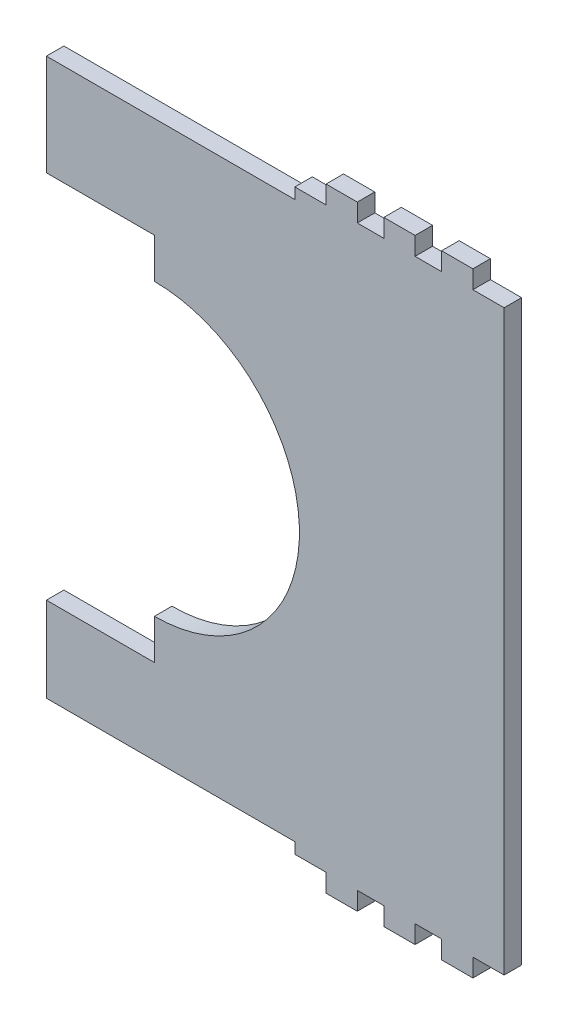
ISO-10303-21;
HEADER;
FILE_DESCRIPTION(('STEP AP214'),'2;1');
FILE_NAME('part.step','',(''),(''),'','','');
FILE_SCHEMA(('AUTOMOTIVE_DESIGN { 1 0 10303 214 1 1 1 1 }'));
ENDSEC;
DATA;
#1=APPLICATION_CONTEXT('core data for automotive mechanical design processes');
#2=APPLICATION_PROTOCOL_DEFINITION('international standard','automotive_design',2000,#1);
#3=PRODUCT_CONTEXT('',#1,'mechanical');
#4=PRODUCT('Part','Part','',(#3));
#5=PRODUCT_RELATED_PRODUCT_CATEGORY('part','',(#4));
#6=PRODUCT_DEFINITION_FORMATION('','',#4);
#7=PRODUCT_DEFINITION_CONTEXT('part definition',#1,'design');
#8=PRODUCT_DEFINITION('design','',#6,#7);
#9=PRODUCT_DEFINITION_SHAPE('','',#8);
#10=(LENGTH_UNIT() NAMED_UNIT(*) SI_UNIT(.MILLI.,.METRE.));
#11=(NAMED_UNIT(*) PLANE_ANGLE_UNIT() SI_UNIT($,.RADIAN.));
#12=(NAMED_UNIT(*) SI_UNIT($,.STERADIAN.) SOLID_ANGLE_UNIT());
#13=UNCERTAINTY_MEASURE_WITH_UNIT(LENGTH_MEASURE(1.E-05),#10,'distance_accuracy_value','');
#14=(GEOMETRIC_REPRESENTATION_CONTEXT(3) GLOBAL_UNCERTAINTY_ASSIGNED_CONTEXT((#13)) GLOBAL_UNIT_ASSIGNED_CONTEXT((#10,
#11,#12)) REPRESENTATION_CONTEXT('',''));
#15=CARTESIAN_POINT('',(0.,0.,0.));
#16=DIRECTION('',(0.,0.,1.));
#17=DIRECTION('',(1.,0.,0.));
#18=AXIS2_PLACEMENT_3D('',#15,#16,#17);
#19=CARTESIAN_POINT('',(0.,3.5,5.6));
#20=DIRECTION('',(1.,0.,0.));
#21=DIRECTION('',(0.,1.,0.));
#22=AXIS2_PLACEMENT_3D('',#19,#20,#21);
#23=PLANE('',#22);
#24=DIRECTION('',(0.,-1.,0.));
#25=VECTOR('',#24,1.);
#26=CARTESIAN_POINT('',(0.,3.5,0.));
#27=LINE('',#26,#25);
#28=CARTESIAN_POINT('',(0.,3.5,0.));
#29=VERTEX_POINT('',#28);
#30=CARTESIAN_POINT('',(0.,0.,0.));
#31=VERTEX_POINT('',#30);
#32=EDGE_CURVE('E314',#29,#31,#27,.T.);
#33=ORIENTED_EDGE('',*,*,#32,.T.);
#34=DIRECTION('',(0.,0.,-1.));
#35=VECTOR('',#34,1.);
#36=CARTESIAN_POINT('',(0.,0.,5.6));
#37=LINE('',#36,#35);
#38=CARTESIAN_POINT('',(0.,0.,5.6));
#39=VERTEX_POINT('',#38);
#40=EDGE_CURVE('E11',#39,#31,#37,.T.);
#41=ORIENTED_EDGE('',*,*,#40,.F.);
#42=DIRECTION('',(0.,-1.,0.));
#43=VECTOR('',#42,1.);
#44=CARTESIAN_POINT('',(0.,3.5,5.6));
#45=LINE('',#44,#43);
#46=CARTESIAN_POINT('',(0.,3.5,5.6));
#47=VERTEX_POINT('',#46);
#48=EDGE_CURVE('E390',#47,#39,#45,.T.);
#49=ORIENTED_EDGE('',*,*,#48,.F.);
#50=DIRECTION('',(0.,0.,-1.));
#51=VECTOR('',#50,1.);
#52=CARTESIAN_POINT('',(0.,3.5,5.6));
#53=LINE('',#52,#51);
#54=EDGE_CURVE('E310',#47,#29,#53,.T.);
#55=ORIENTED_EDGE('',*,*,#54,.T.);
#56=EDGE_LOOP('',(#33,#41,#49,#55));
#57=FACE_BOUND('',#56,.T.);
#58=ADVANCED_FACE('F37',(#57),#23,.F.);
#59=CARTESIAN_POINT('',(0.,0.,5.6));
#60=DIRECTION('',(0.,1.,0.));
#61=DIRECTION('',(0.,0.,1.));
#62=AXIS2_PLACEMENT_3D('',#59,#60,#61);
#63=PLANE('',#62);
#64=DIRECTION('',(1.,0.,0.));
#65=VECTOR('',#64,1.);
#66=CARTESIAN_POINT('',(0.,0.,0.));
#67=LINE('',#66,#65);
#68=CARTESIAN_POINT('',(9.99999999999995,0.,0.));
#69=VERTEX_POINT('',#68);
#70=EDGE_CURVE('E317',#31,#69,#67,.T.);
#71=ORIENTED_EDGE('',*,*,#70,.T.);
#72=DIRECTION('',(0.,0.,-1.));
#73=VECTOR('',#72,1.);
#74=CARTESIAN_POINT('',(9.99999999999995,0.,5.6));
#75=LINE('',#74,#73);
#76=CARTESIAN_POINT('',(9.99999999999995,0.,5.6));
#77=VERTEX_POINT('',#76);
#78=EDGE_CURVE('E45',#77,#69,#75,.T.);
#79=ORIENTED_EDGE('',*,*,#78,.F.);
#80=DIRECTION('',(1.,0.,0.));
#81=VECTOR('',#80,1.);
#82=CARTESIAN_POINT('',(0.,0.,5.6));
#83=LINE('',#82,#81);
#84=EDGE_CURVE('E184',#39,#77,#83,.T.);
#85=ORIENTED_EDGE('',*,*,#84,.F.);
#86=ORIENTED_EDGE('',*,*,#40,.T.);
#87=EDGE_LOOP('',(#71,#79,#85,#86));
#88=FACE_BOUND('',#87,.T.);
#89=ADVANCED_FACE('F588',(#88),#63,.F.);
#90=CARTESIAN_POINT('',(9.99999999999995,0.,5.6));
#91=DIRECTION('',(1.,0.,0.));
#92=DIRECTION('',(0.,1.,0.));
#93=AXIS2_PLACEMENT_3D('',#90,#91,#92);
#94=PLANE('',#93);
#95=DIRECTION('',(0.,-1.,0.));
#96=VECTOR('',#95,1.);
#97=CARTESIAN_POINT('',(9.99999999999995,0.,0.));
#98=LINE('',#97,#96);
#99=CARTESIAN_POINT('',(9.99999999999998,-5.8,0.));
#100=VERTEX_POINT('',#99);
#101=EDGE_CURVE('E319',#69,#100,#98,.T.);
#102=ORIENTED_EDGE('',*,*,#101,.T.);
#103=DIRECTION('',(0.,0.,-1.));
#104=VECTOR('',#103,1.);
#105=CARTESIAN_POINT('',(9.99999999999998,-5.8,5.6));
#106=LINE('',#105,#104);
#107=CARTESIAN_POINT('',(9.99999999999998,-5.8,5.6));
#108=VERTEX_POINT('',#107);
#109=EDGE_CURVE('E487',#108,#100,#106,.T.);
#110=ORIENTED_EDGE('',*,*,#109,.F.);
#111=DIRECTION('',(0.,-1.,0.));
#112=VECTOR('',#111,1.);
#113=CARTESIAN_POINT('',(9.99999999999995,0.,5.6));
#114=LINE('',#113,#112);
#115=EDGE_CURVE('E495',#77,#108,#114,.T.);
#116=ORIENTED_EDGE('',*,*,#115,.F.);
#117=ORIENTED_EDGE('',*,*,#78,.T.);
#118=EDGE_LOOP('',(#102,#110,#116,#117));
#119=FACE_BOUND('',#118,.T.);
#120=ADVANCED_FACE('F493',(#119),#94,.F.);
#121=CARTESIAN_POINT('',(9.99999999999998,-5.8,5.6));
#122=DIRECTION('',(0.,1.,0.));
#123=DIRECTION('',(0.,0.,1.));
#124=AXIS2_PLACEMENT_3D('',#121,#122,#123);
#125=PLANE('',#124);
#126=DIRECTION('',(1.,0.,0.));
#127=VECTOR('',#126,1.);
#128=CARTESIAN_POINT('',(9.99999999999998,-5.8,0.));
#129=LINE('',#128,#127);
#130=CARTESIAN_POINT('',(20.,-5.8,0.));
#131=VERTEX_POINT('',#130);
#132=EDGE_CURVE('E321',#100,#131,#129,.T.);
#133=ORIENTED_EDGE('',*,*,#132,.T.);
#134=DIRECTION('',(0.,0.,-1.));
#135=VECTOR('',#134,1.);
#136=CARTESIAN_POINT('',(20.,-5.8,5.6));
#137=LINE('',#136,#135);
#138=CARTESIAN_POINT('',(20.,-5.8,5.6));
#139=VERTEX_POINT('',#138);
#140=EDGE_CURVE('E484',#139,#131,#137,.T.);
#141=ORIENTED_EDGE('',*,*,#140,.F.);
#142=DIRECTION('',(1.,0.,0.));
#143=VECTOR('',#142,1.);
#144=CARTESIAN_POINT('',(9.99999999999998,-5.8,5.6));
#145=LINE('',#144,#143);
#146=EDGE_CURVE('E511',#108,#139,#145,.T.);
#147=ORIENTED_EDGE('',*,*,#146,.F.);
#148=ORIENTED_EDGE('',*,*,#109,.T.);
#149=EDGE_LOOP('',(#133,#141,#147,#148));
#150=FACE_BOUND('',#149,.T.);
#151=ADVANCED_FACE('F502',(#150),#125,.F.);
#152=CARTESIAN_POINT('',(20.,-5.8,5.6));
#153=DIRECTION('',(-1.,0.,0.));
#154=DIRECTION('',(0.,-1.,0.));
#155=AXIS2_PLACEMENT_3D('',#152,#153,#154);
#156=PLANE('',#155);
#157=DIRECTION('',(0.,1.,0.));
#158=VECTOR('',#157,1.);
#159=CARTESIAN_POINT('',(20.,-5.8,0.));
#160=LINE('',#159,#158);
#161=CARTESIAN_POINT('',(20.,0.,0.));
#162=VERTEX_POINT('',#161);
#163=EDGE_CURVE('E323',#131,#162,#160,.T.);
#164=ORIENTED_EDGE('',*,*,#163,.T.);
#165=DIRECTION('',(0.,0.,-1.));
#166=VECTOR('',#165,1.);
#167=CARTESIAN_POINT('',(20.,0.,5.6));
#168=LINE('',#167,#166);
#169=CARTESIAN_POINT('',(20.,0.,5.6));
#170=VERTEX_POINT('',#169);
#171=EDGE_CURVE('E481',#170,#162,#168,.T.);
#172=ORIENTED_EDGE('',*,*,#171,.F.);
#173=DIRECTION('',(0.,1.,0.));
#174=VECTOR('',#173,1.);
#175=CARTESIAN_POINT('',(20.,-5.8,5.6));
#176=LINE('',#175,#174);
#177=EDGE_CURVE('E508',#139,#170,#176,.T.);
#178=ORIENTED_EDGE('',*,*,#177,.F.);
#179=ORIENTED_EDGE('',*,*,#140,.T.);
#180=EDGE_LOOP('',(#164,#172,#178,#179));
#181=FACE_BOUND('',#180,.T.);
#182=ADVANCED_FACE('F506',(#181),#156,.F.);
#183=CARTESIAN_POINT('',(20.,0.,5.6));
#184=DIRECTION('',(0.,1.,0.));
#185=DIRECTION('',(0.,0.,1.));
#186=AXIS2_PLACEMENT_3D('',#183,#184,#185);
#187=PLANE('',#186);
#188=DIRECTION('',(1.,0.,0.));
#189=VECTOR('',#188,1.);
#190=CARTESIAN_POINT('',(20.,0.,0.));
#191=LINE('',#190,#189);
#192=CARTESIAN_POINT('',(28.5,0.,0.));
#193=VERTEX_POINT('',#192);
#194=EDGE_CURVE('E325',#162,#193,#191,.T.);
#195=ORIENTED_EDGE('',*,*,#194,.T.);
#196=DIRECTION('',(0.,0.,-1.));
#197=VECTOR('',#196,1.);
#198=CARTESIAN_POINT('',(28.5,0.,5.6));
#199=LINE('',#198,#197);
#200=CARTESIAN_POINT('',(28.5,0.,5.6));
#201=VERTEX_POINT('',#200);
#202=EDGE_CURVE('E478',#201,#193,#199,.T.);
#203=ORIENTED_EDGE('',*,*,#202,.F.);
#204=DIRECTION('',(1.,0.,0.));
#205=VECTOR('',#204,1.);
#206=CARTESIAN_POINT('',(20.,0.,5.6));
#207=LINE('',#206,#205);
#208=EDGE_CURVE('E510',#170,#201,#207,.T.);
#209=ORIENTED_EDGE('',*,*,#208,.F.);
#210=ORIENTED_EDGE('',*,*,#171,.T.);
#211=EDGE_LOOP('',(#195,#203,#209,#210));
#212=FACE_BOUND('',#211,.T.);
#213=ADVANCED_FACE('F600',(#212),#187,.F.);
#214=CARTESIAN_POINT('',(28.5,0.,5.6));
#215=DIRECTION('',(1.,0.,0.));
#216=DIRECTION('',(0.,1.,0.));
#217=AXIS2_PLACEMENT_3D('',#214,#215,#216);
#218=PLANE('',#217);
#219=DIRECTION('',(0.,-1.,0.));
#220=VECTOR('',#219,1.);
#221=CARTESIAN_POINT('',(28.5,0.,0.));
#222=LINE('',#221,#220);
#223=CARTESIAN_POINT('',(28.5,-5.8,0.));
#224=VERTEX_POINT('',#223);
#225=EDGE_CURVE('E327',#193,#224,#222,.T.);
#226=ORIENTED_EDGE('',*,*,#225,.T.);
#227=DIRECTION('',(0.,0.,-1.));
#228=VECTOR('',#227,1.);
#229=CARTESIAN_POINT('',(28.5,-5.8,5.6));
#230=LINE('',#229,#228);
#231=CARTESIAN_POINT('',(28.5,-5.8,5.6));
#232=VERTEX_POINT('',#231);
#233=EDGE_CURVE('E475',#232,#224,#230,.T.);
#234=ORIENTED_EDGE('',*,*,#233,.F.);
#235=DIRECTION('',(0.,-1.,0.));
#236=VECTOR('',#235,1.);
#237=CARTESIAN_POINT('',(28.5,0.,5.6));
#238=LINE('',#237,#236);
#239=EDGE_CURVE('E513',#201,#232,#238,.T.);
#240=ORIENTED_EDGE('',*,*,#239,.F.);
#241=ORIENTED_EDGE('',*,*,#202,.T.);
#242=EDGE_LOOP('',(#226,#234,#240,#241));
#243=FACE_BOUND('',#242,.T.);
#244=ADVANCED_FACE('F603',(#243),#218,.F.);
#245=CARTESIAN_POINT('',(28.5,-5.8,5.6));
#246=DIRECTION('',(0.,1.,0.));
#247=DIRECTION('',(0.,0.,1.));
#248=AXIS2_PLACEMENT_3D('',#245,#246,#247);
#249=PLANE('',#248);
#250=DIRECTION('',(1.,0.,0.));
#251=VECTOR('',#250,1.);
#252=CARTESIAN_POINT('',(28.5,-5.8,0.));
#253=LINE('',#252,#251);
#254=CARTESIAN_POINT('',(38.5,-5.8,0.));
#255=VERTEX_POINT('',#254);
#256=EDGE_CURVE('E329',#224,#255,#253,.T.);
#257=ORIENTED_EDGE('',*,*,#256,.T.);
#258=DIRECTION('',(0.,0.,-1.));
#259=VECTOR('',#258,1.);
#260=CARTESIAN_POINT('',(38.5,-5.8,5.6));
#261=LINE('',#260,#259);
#262=CARTESIAN_POINT('',(38.5,-5.8,5.6));
#263=VERTEX_POINT('',#262);
#264=EDGE_CURVE('E472',#263,#255,#261,.T.);
#265=ORIENTED_EDGE('',*,*,#264,.F.);
#266=DIRECTION('',(1.,0.,0.));
#267=VECTOR('',#266,1.);
#268=CARTESIAN_POINT('',(28.5,-5.8,5.6));
#269=LINE('',#268,#267);
#270=EDGE_CURVE('E519',#232,#263,#269,.T.);
#271=ORIENTED_EDGE('',*,*,#270,.F.);
#272=ORIENTED_EDGE('',*,*,#233,.T.);
#273=EDGE_LOOP('',(#257,#265,#271,#272));
#274=FACE_BOUND('',#273,.T.);
#275=ADVANCED_FACE('F607',(#274),#249,.F.);
#276=CARTESIAN_POINT('',(38.5,-5.8,5.6));
#277=DIRECTION('',(-1.,0.,0.));
#278=DIRECTION('',(0.,-1.,0.));
#279=AXIS2_PLACEMENT_3D('',#276,#277,#278);
#280=PLANE('',#279);
#281=DIRECTION('',(0.,1.,0.));
#282=VECTOR('',#281,1.);
#283=CARTESIAN_POINT('',(38.5,-5.8,0.));
#284=LINE('',#283,#282);
#285=CARTESIAN_POINT('',(38.5,0.,0.));
#286=VERTEX_POINT('',#285);
#287=EDGE_CURVE('E331',#255,#286,#284,.T.);
#288=ORIENTED_EDGE('',*,*,#287,.T.);
#289=DIRECTION('',(0.,0.,-1.));
#290=VECTOR('',#289,1.);
#291=CARTESIAN_POINT('',(38.5,0.,5.6));
#292=LINE('',#291,#290);
#293=CARTESIAN_POINT('',(38.5,0.,5.6));
#294=VERTEX_POINT('',#293);
#295=EDGE_CURVE('E469',#294,#286,#292,.T.);
#296=ORIENTED_EDGE('',*,*,#295,.F.);
#297=DIRECTION('',(0.,1.,0.));
#298=VECTOR('',#297,1.);
#299=CARTESIAN_POINT('',(38.5,-5.8,5.6));
#300=LINE('',#299,#298);
#301=EDGE_CURVE('E521',#263,#294,#300,.T.);
#302=ORIENTED_EDGE('',*,*,#301,.F.);
#303=ORIENTED_EDGE('',*,*,#264,.T.);
#304=EDGE_LOOP('',(#288,#296,#302,#303));
#305=FACE_BOUND('',#304,.T.);
#306=ADVANCED_FACE('F611',(#305),#280,.F.);
#307=CARTESIAN_POINT('',(38.5,0.,5.6));
#308=DIRECTION('',(0.,1.,0.));
#309=DIRECTION('',(0.,0.,1.));
#310=AXIS2_PLACEMENT_3D('',#307,#308,#309);
#311=PLANE('',#310);
#312=DIRECTION('',(1.,0.,0.));
#313=VECTOR('',#312,1.);
#314=CARTESIAN_POINT('',(38.5,0.,0.));
#315=LINE('',#314,#313);
#316=CARTESIAN_POINT('',(47.,0.,0.));
#317=VERTEX_POINT('',#316);
#318=EDGE_CURVE('E333',#286,#317,#315,.T.);
#319=ORIENTED_EDGE('',*,*,#318,.T.);
#320=DIRECTION('',(0.,0.,-1.));
#321=VECTOR('',#320,1.);
#322=CARTESIAN_POINT('',(47.,0.,5.6));
#323=LINE('',#322,#321);
#324=CARTESIAN_POINT('',(47.,0.,5.6));
#325=VERTEX_POINT('',#324);
#326=EDGE_CURVE('E466',#325,#317,#323,.T.);
#327=ORIENTED_EDGE('',*,*,#326,.F.);
#328=DIRECTION('',(1.,0.,0.));
#329=VECTOR('',#328,1.);
#330=CARTESIAN_POINT('',(38.5,0.,5.6));
#331=LINE('',#330,#329);
#332=EDGE_CURVE('E523',#294,#325,#331,.T.);
#333=ORIENTED_EDGE('',*,*,#332,.F.);
#334=ORIENTED_EDGE('',*,*,#295,.T.);
#335=EDGE_LOOP('',(#319,#327,#333,#334));
#336=FACE_BOUND('',#335,.T.);
#337=ADVANCED_FACE('F615',(#336),#311,.F.);
#338=CARTESIAN_POINT('',(47.,0.,5.6));
#339=DIRECTION('',(1.,0.,0.));
#340=DIRECTION('',(0.,0.,-1.));
#341=AXIS2_PLACEMENT_3D('',#338,#339,#340);
#342=PLANE('',#341);
#343=DIRECTION('',(0.,-1.,0.));
#344=VECTOR('',#343,1.);
#345=CARTESIAN_POINT('',(47.,0.,0.));
#346=LINE('',#345,#344);
#347=CARTESIAN_POINT('',(47.,-5.8,0.));
#348=VERTEX_POINT('',#347);
#349=EDGE_CURVE('E335',#317,#348,#346,.T.);
#350=ORIENTED_EDGE('',*,*,#349,.T.);
#351=DIRECTION('',(0.,0.,-1.));
#352=VECTOR('',#351,1.);
#353=CARTESIAN_POINT('',(47.,-5.8,5.6));
#354=LINE('',#353,#352);
#355=CARTESIAN_POINT('',(47.,-5.8,5.6));
#356=VERTEX_POINT('',#355);
#357=EDGE_CURVE('E463',#356,#348,#354,.T.);
#358=ORIENTED_EDGE('',*,*,#357,.F.);
#359=DIRECTION('',(0.,-1.,0.));
#360=VECTOR('',#359,1.);
#361=CARTESIAN_POINT('',(47.,0.,5.6));
#362=LINE('',#361,#360);
#363=EDGE_CURVE('E525',#325,#356,#362,.T.);
#364=ORIENTED_EDGE('',*,*,#363,.F.);
#365=ORIENTED_EDGE('',*,*,#326,.T.);
#366=EDGE_LOOP('',(#350,#358,#364,#365));
#367=FACE_BOUND('',#366,.T.);
#368=ADVANCED_FACE('F619',(#367),#342,.F.);
#369=CARTESIAN_POINT('',(47.,-5.8,5.6));
#370=DIRECTION('',(0.,1.,0.));
#371=DIRECTION('',(0.,0.,1.));
#372=AXIS2_PLACEMENT_3D('',#369,#370,#371);
#373=PLANE('',#372);
#374=DIRECTION('',(1.,0.,0.));
#375=VECTOR('',#374,1.);
#376=CARTESIAN_POINT('',(47.,-5.8,0.));
#377=LINE('',#376,#375);
#378=CARTESIAN_POINT('',(57.,-5.8,0.));
#379=VERTEX_POINT('',#378);
#380=EDGE_CURVE('E337',#348,#379,#377,.T.);
#381=ORIENTED_EDGE('',*,*,#380,.T.);
#382=DIRECTION('',(0.,0.,-1.));
#383=VECTOR('',#382,1.);
#384=CARTESIAN_POINT('',(57.,-5.8,5.6));
#385=LINE('',#384,#383);
#386=CARTESIAN_POINT('',(57.,-5.8,5.6));
#387=VERTEX_POINT('',#386);
#388=EDGE_CURVE('E460',#387,#379,#385,.T.);
#389=ORIENTED_EDGE('',*,*,#388,.F.);
#390=DIRECTION('',(1.,0.,0.));
#391=VECTOR('',#390,1.);
#392=CARTESIAN_POINT('',(47.,-5.8,5.6));
#393=LINE('',#392,#391);
#394=EDGE_CURVE('E527',#356,#387,#393,.T.);
#395=ORIENTED_EDGE('',*,*,#394,.F.);
#396=ORIENTED_EDGE('',*,*,#357,.T.);
#397=EDGE_LOOP('',(#381,#389,#395,#396));
#398=FACE_BOUND('',#397,.T.);
#399=ADVANCED_FACE('F623',(#398),#373,.F.);
#400=CARTESIAN_POINT('',(57.,-5.8,5.6));
#401=DIRECTION('',(-1.,0.,0.));
#402=DIRECTION('',(0.,-1.,0.));
#403=AXIS2_PLACEMENT_3D('',#400,#401,#402);
#404=PLANE('',#403);
#405=DIRECTION('',(0.,1.,0.));
#406=VECTOR('',#405,1.);
#407=CARTESIAN_POINT('',(57.,-5.8,0.));
#408=LINE('',#407,#406);
#409=CARTESIAN_POINT('',(57.,0.,0.));
#410=VERTEX_POINT('',#409);
#411=EDGE_CURVE('E339',#379,#410,#408,.T.);
#412=ORIENTED_EDGE('',*,*,#411,.T.);
#413=DIRECTION('',(0.,0.,-1.));
#414=VECTOR('',#413,1.);
#415=CARTESIAN_POINT('',(57.,0.,5.6));
#416=LINE('',#415,#414);
#417=CARTESIAN_POINT('',(57.,0.,5.6));
#418=VERTEX_POINT('',#417);
#419=EDGE_CURVE('E457',#418,#410,#416,.T.);
#420=ORIENTED_EDGE('',*,*,#419,.F.);
#421=DIRECTION('',(0.,1.,0.));
#422=VECTOR('',#421,1.);
#423=CARTESIAN_POINT('',(57.,-5.8,5.6));
#424=LINE('',#423,#422);
#425=EDGE_CURVE('E529',#387,#418,#424,.T.);
#426=ORIENTED_EDGE('',*,*,#425,.F.);
#427=ORIENTED_EDGE('',*,*,#388,.T.);
#428=EDGE_LOOP('',(#412,#420,#426,#427));
#429=FACE_BOUND('',#428,.T.);
#430=ADVANCED_FACE('F627',(#429),#404,.F.);
#431=CARTESIAN_POINT('',(57.,0.,5.6));
#432=DIRECTION('',(0.,1.,0.));
#433=DIRECTION('',(0.,0.,1.));
#434=AXIS2_PLACEMENT_3D('',#431,#432,#433);
#435=PLANE('',#434);
#436=DIRECTION('',(1.,0.,0.));
#437=VECTOR('',#436,1.);
#438=CARTESIAN_POINT('',(57.,0.,0.));
#439=LINE('',#438,#437);
#440=CARTESIAN_POINT('',(67.,0.,0.));
#441=VERTEX_POINT('',#440);
#442=EDGE_CURVE('E341',#410,#441,#439,.T.);
#443=ORIENTED_EDGE('',*,*,#442,.T.);
#444=DIRECTION('',(0.,0.,-1.));
#445=VECTOR('',#444,1.);
#446=CARTESIAN_POINT('',(67.,0.,5.6));
#447=LINE('',#446,#445);
#448=CARTESIAN_POINT('',(67.,0.,5.6));
#449=VERTEX_POINT('',#448);
#450=EDGE_CURVE('E454',#449,#441,#447,.T.);
#451=ORIENTED_EDGE('',*,*,#450,.F.);
#452=DIRECTION('',(1.,0.,0.));
#453=VECTOR('',#452,1.);
#454=CARTESIAN_POINT('',(57.,0.,5.6));
#455=LINE('',#454,#453);
#456=EDGE_CURVE('E531',#418,#449,#455,.T.);
#457=ORIENTED_EDGE('',*,*,#456,.F.);
#458=ORIENTED_EDGE('',*,*,#419,.T.);
#459=EDGE_LOOP('',(#443,#451,#457,#458));
#460=FACE_BOUND('',#459,.T.);
#461=ADVANCED_FACE('F631',(#460),#435,.F.);
#462=CARTESIAN_POINT('',(67.,0.,5.6));
#463=DIRECTION('',(-1.,0.,0.));
#464=DIRECTION('',(0.,-1.,0.));
#465=AXIS2_PLACEMENT_3D('',#462,#463,#464);
#466=PLANE('',#465);
#467=DIRECTION('',(0.,1.,0.));
#468=VECTOR('',#467,1.);
#469=CARTESIAN_POINT('',(67.,0.,0.));
#470=LINE('',#469,#468);
#471=CARTESIAN_POINT('',(67.,185.,0.));
#472=VERTEX_POINT('',#471);
#473=EDGE_CURVE('E343',#441,#472,#470,.T.);
#474=ORIENTED_EDGE('',*,*,#473,.T.);
#475=DIRECTION('',(0.,0.,-1.));
#476=VECTOR('',#475,1.);
#477=CARTESIAN_POINT('',(67.,185.,5.6));
#478=LINE('',#477,#476);
#479=CARTESIAN_POINT('',(67.,185.,5.6));
#480=VERTEX_POINT('',#479);
#481=EDGE_CURVE('E451',#480,#472,#478,.T.);
#482=ORIENTED_EDGE('',*,*,#481,.F.);
#483=DIRECTION('',(0.,1.,0.));
#484=VECTOR('',#483,1.);
#485=CARTESIAN_POINT('',(67.,0.,5.6));
#486=LINE('',#485,#484);
#487=EDGE_CURVE('E533',#449,#480,#486,.T.);
#488=ORIENTED_EDGE('',*,*,#487,.F.);
#489=ORIENTED_EDGE('',*,*,#450,.T.);
#490=EDGE_LOOP('',(#474,#482,#488,#489));
#491=FACE_BOUND('',#490,.T.);
#492=ADVANCED_FACE('F635',(#491),#466,.F.);
#493=CARTESIAN_POINT('',(67.,185.,5.6));
#494=DIRECTION('',(0.,-1.,0.));
#495=DIRECTION('',(0.,0.,-1.));
#496=AXIS2_PLACEMENT_3D('',#493,#494,#495);
#497=PLANE('',#496);
#498=DIRECTION('',(-1.,0.,0.));
#499=VECTOR('',#498,1.);
#500=CARTESIAN_POINT('',(67.,185.,0.));
#501=LINE('',#500,#499);
#502=CARTESIAN_POINT('',(57.,185.,0.));
#503=VERTEX_POINT('',#502);
#504=EDGE_CURVE('E345',#472,#503,#501,.T.);
#505=ORIENTED_EDGE('',*,*,#504,.T.);
#506=DIRECTION('',(0.,0.,-1.));
#507=VECTOR('',#506,1.);
#508=CARTESIAN_POINT('',(57.,185.,5.6));
#509=LINE('',#508,#507);
#510=CARTESIAN_POINT('',(57.,185.,5.6));
#511=VERTEX_POINT('',#510);
#512=EDGE_CURVE('E448',#511,#503,#509,.T.);
#513=ORIENTED_EDGE('',*,*,#512,.F.);
#514=DIRECTION('',(-1.,0.,0.));
#515=VECTOR('',#514,1.);
#516=CARTESIAN_POINT('',(67.,185.,5.6));
#517=LINE('',#516,#515);
#518=EDGE_CURVE('E535',#480,#511,#517,.T.);
#519=ORIENTED_EDGE('',*,*,#518,.F.);
#520=ORIENTED_EDGE('',*,*,#481,.T.);
#521=EDGE_LOOP('',(#505,#513,#519,#520));
#522=FACE_BOUND('',#521,.T.);
#523=ADVANCED_FACE('F639',(#522),#497,.F.);
#524=CARTESIAN_POINT('',(57.,185.,5.6));
#525=DIRECTION('',(-1.,0.,0.));
#526=DIRECTION('',(0.,0.,1.));
#527=AXIS2_PLACEMENT_3D('',#524,#525,#526);
#528=PLANE('',#527);
#529=DIRECTION('',(0.,1.,0.));
#530=VECTOR('',#529,1.);
#531=CARTESIAN_POINT('',(57.,185.,0.));
#532=LINE('',#531,#530);
#533=CARTESIAN_POINT('',(57.,190.8,0.));
#534=VERTEX_POINT('',#533);
#535=EDGE_CURVE('E347',#503,#534,#532,.T.);
#536=ORIENTED_EDGE('',*,*,#535,.T.);
#537=DIRECTION('',(0.,0.,-1.));
#538=VECTOR('',#537,1.);
#539=CARTESIAN_POINT('',(57.,190.8,5.6));
#540=LINE('',#539,#538);
#541=CARTESIAN_POINT('',(57.,190.8,5.6));
#542=VERTEX_POINT('',#541);
#543=EDGE_CURVE('E445',#542,#534,#540,.T.);
#544=ORIENTED_EDGE('',*,*,#543,.F.);
#545=DIRECTION('',(0.,1.,0.));
#546=VECTOR('',#545,1.);
#547=CARTESIAN_POINT('',(57.,185.,5.6));
#548=LINE('',#547,#546);
#549=EDGE_CURVE('E537',#511,#542,#548,.T.);
#550=ORIENTED_EDGE('',*,*,#549,.F.);
#551=ORIENTED_EDGE('',*,*,#512,.T.);
#552=EDGE_LOOP('',(#536,#544,#550,#551));
#553=FACE_BOUND('',#552,.T.);
#554=ADVANCED_FACE('F643',(#553),#528,.F.);
#555=CARTESIAN_POINT('',(57.,190.8,5.6));
#556=DIRECTION('',(0.,-1.,0.));
#557=DIRECTION('',(0.,0.,-1.));
#558=AXIS2_PLACEMENT_3D('',#555,#556,#557);
#559=PLANE('',#558);
#560=DIRECTION('',(-1.,0.,0.));
#561=VECTOR('',#560,1.);
#562=CARTESIAN_POINT('',(57.,190.8,0.));
#563=LINE('',#562,#561);
#564=CARTESIAN_POINT('',(47.,190.8,0.));
#565=VERTEX_POINT('',#564);
#566=EDGE_CURVE('E349',#534,#565,#563,.T.);
#567=ORIENTED_EDGE('',*,*,#566,.T.);
#568=DIRECTION('',(0.,0.,-1.));
#569=VECTOR('',#568,1.);
#570=CARTESIAN_POINT('',(47.,190.8,5.6));
#571=LINE('',#570,#569);
#572=CARTESIAN_POINT('',(47.,190.8,5.6));
#573=VERTEX_POINT('',#572);
#574=EDGE_CURVE('E442',#573,#565,#571,.T.);
#575=ORIENTED_EDGE('',*,*,#574,.F.);
#576=DIRECTION('',(-1.,0.,0.));
#577=VECTOR('',#576,1.);
#578=CARTESIAN_POINT('',(57.,190.8,5.6));
#579=LINE('',#578,#577);
#580=EDGE_CURVE('E539',#542,#573,#579,.T.);
#581=ORIENTED_EDGE('',*,*,#580,.F.);
#582=ORIENTED_EDGE('',*,*,#543,.T.);
#583=EDGE_LOOP('',(#567,#575,#581,#582));
#584=FACE_BOUND('',#583,.T.);
#585=ADVANCED_FACE('F647',(#584),#559,.F.);
#586=CARTESIAN_POINT('',(47.,190.8,5.6));
#587=DIRECTION('',(1.,0.,0.));
#588=DIRECTION('',(0.,0.,-1.));
#589=AXIS2_PLACEMENT_3D('',#586,#587,#588);
#590=PLANE('',#589);
#591=DIRECTION('',(0.,-1.,0.));
#592=VECTOR('',#591,1.);
#593=CARTESIAN_POINT('',(47.,190.8,0.));
#594=LINE('',#593,#592);
#595=CARTESIAN_POINT('',(47.,185.,0.));
#596=VERTEX_POINT('',#595);
#597=EDGE_CURVE('E351',#565,#596,#594,.T.);
#598=ORIENTED_EDGE('',*,*,#597,.T.);
#599=DIRECTION('',(0.,0.,-1.));
#600=VECTOR('',#599,1.);
#601=CARTESIAN_POINT('',(47.,185.,5.6));
#602=LINE('',#601,#600);
#603=CARTESIAN_POINT('',(47.,185.,5.6));
#604=VERTEX_POINT('',#603);
#605=EDGE_CURVE('E439',#604,#596,#602,.T.);
#606=ORIENTED_EDGE('',*,*,#605,.F.);
#607=DIRECTION('',(0.,-1.,0.));
#608=VECTOR('',#607,1.);
#609=CARTESIAN_POINT('',(47.,190.8,5.6));
#610=LINE('',#609,#608);
#611=EDGE_CURVE('E541',#573,#604,#610,.T.);
#612=ORIENTED_EDGE('',*,*,#611,.F.);
#613=ORIENTED_EDGE('',*,*,#574,.T.);
#614=EDGE_LOOP('',(#598,#606,#612,#613));
#615=FACE_BOUND('',#614,.T.);
#616=ADVANCED_FACE('F651',(#615),#590,.F.);
#617=CARTESIAN_POINT('',(47.,185.,5.6));
#618=DIRECTION('',(0.,-1.,0.));
#619=DIRECTION('',(0.,0.,-1.));
#620=AXIS2_PLACEMENT_3D('',#617,#618,#619);
#621=PLANE('',#620);
#622=DIRECTION('',(-1.,0.,0.));
#623=VECTOR('',#622,1.);
#624=CARTESIAN_POINT('',(47.,185.,0.));
#625=LINE('',#624,#623);
#626=CARTESIAN_POINT('',(38.5,185.,0.));
#627=VERTEX_POINT('',#626);
#628=EDGE_CURVE('E353',#596,#627,#625,.T.);
#629=ORIENTED_EDGE('',*,*,#628,.T.);
#630=DIRECTION('',(0.,0.,-1.));
#631=VECTOR('',#630,1.);
#632=CARTESIAN_POINT('',(38.5,185.,5.6));
#633=LINE('',#632,#631);
#634=CARTESIAN_POINT('',(38.5,185.,5.6));
#635=VERTEX_POINT('',#634);
#636=EDGE_CURVE('E436',#635,#627,#633,.T.);
#637=ORIENTED_EDGE('',*,*,#636,.F.);
#638=DIRECTION('',(-1.,0.,0.));
#639=VECTOR('',#638,1.);
#640=CARTESIAN_POINT('',(47.,185.,5.6));
#641=LINE('',#640,#639);
#642=EDGE_CURVE('E543',#604,#635,#641,.T.);
#643=ORIENTED_EDGE('',*,*,#642,.F.);
#644=ORIENTED_EDGE('',*,*,#605,.T.);
#645=EDGE_LOOP('',(#629,#637,#643,#644));
#646=FACE_BOUND('',#645,.T.);
#647=ADVANCED_FACE('F655',(#646),#621,.F.);
#648=CARTESIAN_POINT('',(38.5,185.,5.6));
#649=DIRECTION('',(-1.,0.,0.));
#650=DIRECTION('',(0.,0.,1.));
#651=AXIS2_PLACEMENT_3D('',#648,#649,#650);
#652=PLANE('',#651);
#653=DIRECTION('',(0.,1.,0.));
#654=VECTOR('',#653,1.);
#655=CARTESIAN_POINT('',(38.5,185.,0.));
#656=LINE('',#655,#654);
#657=CARTESIAN_POINT('',(38.5,190.8,0.));
#658=VERTEX_POINT('',#657);
#659=EDGE_CURVE('E355',#627,#658,#656,.T.);
#660=ORIENTED_EDGE('',*,*,#659,.T.);
#661=DIRECTION('',(0.,0.,-1.));
#662=VECTOR('',#661,1.);
#663=CARTESIAN_POINT('',(38.5,190.8,5.6));
#664=LINE('',#663,#662);
#665=CARTESIAN_POINT('',(38.5,190.8,5.6));
#666=VERTEX_POINT('',#665);
#667=EDGE_CURVE('E433',#666,#658,#664,.T.);
#668=ORIENTED_EDGE('',*,*,#667,.F.);
#669=DIRECTION('',(0.,1.,0.));
#670=VECTOR('',#669,1.);
#671=CARTESIAN_POINT('',(38.5,185.,5.6));
#672=LINE('',#671,#670);
#673=EDGE_CURVE('E545',#635,#666,#672,.T.);
#674=ORIENTED_EDGE('',*,*,#673,.F.);
#675=ORIENTED_EDGE('',*,*,#636,.T.);
#676=EDGE_LOOP('',(#660,#668,#674,#675));
#677=FACE_BOUND('',#676,.T.);
#678=ADVANCED_FACE('F659',(#677),#652,.F.);
#679=CARTESIAN_POINT('',(38.5,190.8,5.6));
#680=DIRECTION('',(0.,-1.,0.));
#681=DIRECTION('',(1.,0.,0.));
#682=AXIS2_PLACEMENT_3D('',#679,#680,#681);
#683=PLANE('',#682);
#684=DIRECTION('',(-1.,0.,0.));
#685=VECTOR('',#684,1.);
#686=CARTESIAN_POINT('',(38.5,190.8,0.));
#687=LINE('',#686,#685);
#688=CARTESIAN_POINT('',(28.5,190.8,0.));
#689=VERTEX_POINT('',#688);
#690=EDGE_CURVE('E357',#658,#689,#687,.T.);
#691=ORIENTED_EDGE('',*,*,#690,.T.);
#692=DIRECTION('',(0.,0.,-1.));
#693=VECTOR('',#692,1.);
#694=CARTESIAN_POINT('',(28.5,190.8,5.6));
#695=LINE('',#694,#693);
#696=CARTESIAN_POINT('',(28.5,190.8,5.6));
#697=VERTEX_POINT('',#696);
#698=EDGE_CURVE('E430',#697,#689,#695,.T.);
#699=ORIENTED_EDGE('',*,*,#698,.F.);
#700=DIRECTION('',(-1.,0.,0.));
#701=VECTOR('',#700,1.);
#702=CARTESIAN_POINT('',(38.5,190.8,5.6));
#703=LINE('',#702,#701);
#704=EDGE_CURVE('E547',#666,#697,#703,.T.);
#705=ORIENTED_EDGE('',*,*,#704,.F.);
#706=ORIENTED_EDGE('',*,*,#667,.T.);
#707=EDGE_LOOP('',(#691,#699,#705,#706));
#708=FACE_BOUND('',#707,.T.);
#709=ADVANCED_FACE('F663',(#708),#683,.F.);
#710=CARTESIAN_POINT('',(28.5,190.8,5.6));
#711=DIRECTION('',(1.,0.,0.));
#712=DIRECTION('',(0.,1.,0.));
#713=AXIS2_PLACEMENT_3D('',#710,#711,#712);
#714=PLANE('',#713);
#715=DIRECTION('',(0.,-1.,0.));
#716=VECTOR('',#715,1.);
#717=CARTESIAN_POINT('',(28.5,190.8,0.));
#718=LINE('',#717,#716);
#719=CARTESIAN_POINT('',(28.5,185.,0.));
#720=VERTEX_POINT('',#719);
#721=EDGE_CURVE('E359',#689,#720,#718,.T.);
#722=ORIENTED_EDGE('',*,*,#721,.T.);
#723=DIRECTION('',(0.,0.,-1.));
#724=VECTOR('',#723,1.);
#725=CARTESIAN_POINT('',(28.5,185.,5.6));
#726=LINE('',#725,#724);
#727=CARTESIAN_POINT('',(28.5,185.,5.6));
#728=VERTEX_POINT('',#727);
#729=EDGE_CURVE('E427',#728,#720,#726,.T.);
#730=ORIENTED_EDGE('',*,*,#729,.F.);
#731=DIRECTION('',(0.,-1.,0.));
#732=VECTOR('',#731,1.);
#733=CARTESIAN_POINT('',(28.5,190.8,5.6));
#734=LINE('',#733,#732);
#735=EDGE_CURVE('E549',#697,#728,#734,.T.);
#736=ORIENTED_EDGE('',*,*,#735,.F.);
#737=ORIENTED_EDGE('',*,*,#698,.T.);
#738=EDGE_LOOP('',(#722,#730,#736,#737));
#739=FACE_BOUND('',#738,.T.);
#740=ADVANCED_FACE('F667',(#739),#714,.F.);
#741=CARTESIAN_POINT('',(28.5,185.,5.6));
#742=DIRECTION('',(0.,-1.,0.));
#743=DIRECTION('',(0.,0.,-1.));
#744=AXIS2_PLACEMENT_3D('',#741,#742,#743);
#745=PLANE('',#744);
#746=DIRECTION('',(-1.,0.,0.));
#747=VECTOR('',#746,1.);
#748=CARTESIAN_POINT('',(28.5,185.,0.));
#749=LINE('',#748,#747);
#750=CARTESIAN_POINT('',(20.,185.,0.));
#751=VERTEX_POINT('',#750);
#752=EDGE_CURVE('E361',#720,#751,#749,.T.);
#753=ORIENTED_EDGE('',*,*,#752,.T.);
#754=DIRECTION('',(0.,0.,-1.));
#755=VECTOR('',#754,1.);
#756=CARTESIAN_POINT('',(20.,185.,5.6));
#757=LINE('',#756,#755);
#758=CARTESIAN_POINT('',(20.,185.,5.6));
#759=VERTEX_POINT('',#758);
#760=EDGE_CURVE('E424',#759,#751,#757,.T.);
#761=ORIENTED_EDGE('',*,*,#760,.F.);
#762=DIRECTION('',(-1.,0.,0.));
#763=VECTOR('',#762,1.);
#764=CARTESIAN_POINT('',(28.5,185.,5.6));
#765=LINE('',#764,#763);
#766=EDGE_CURVE('E551',#728,#759,#765,.T.);
#767=ORIENTED_EDGE('',*,*,#766,.F.);
#768=ORIENTED_EDGE('',*,*,#729,.T.);
#769=EDGE_LOOP('',(#753,#761,#767,#768));
#770=FACE_BOUND('',#769,.T.);
#771=ADVANCED_FACE('F671',(#770),#745,.F.);
#772=CARTESIAN_POINT('',(20.,185.,5.6));
#773=DIRECTION('',(-1.,0.,0.));
#774=DIRECTION('',(0.,0.,1.));
#775=AXIS2_PLACEMENT_3D('',#772,#773,#774);
#776=PLANE('',#775);
#777=DIRECTION('',(0.,1.,0.));
#778=VECTOR('',#777,1.);
#779=CARTESIAN_POINT('',(20.,185.,0.));
#780=LINE('',#779,#778);
#781=CARTESIAN_POINT('',(20.,190.8,0.));
#782=VERTEX_POINT('',#781);
#783=EDGE_CURVE('E363',#751,#782,#780,.T.);
#784=ORIENTED_EDGE('',*,*,#783,.T.);
#785=DIRECTION('',(0.,0.,-1.));
#786=VECTOR('',#785,1.);
#787=CARTESIAN_POINT('',(20.,190.8,5.6));
#788=LINE('',#787,#786);
#789=CARTESIAN_POINT('',(20.,190.8,5.6));
#790=VERTEX_POINT('',#789);
#791=EDGE_CURVE('E421',#790,#782,#788,.T.);
#792=ORIENTED_EDGE('',*,*,#791,.F.);
#793=DIRECTION('',(0.,1.,0.));
#794=VECTOR('',#793,1.);
#795=CARTESIAN_POINT('',(20.,185.,5.6));
#796=LINE('',#795,#794);
#797=EDGE_CURVE('E553',#759,#790,#796,.T.);
#798=ORIENTED_EDGE('',*,*,#797,.F.);
#799=ORIENTED_EDGE('',*,*,#760,.T.);
#800=EDGE_LOOP('',(#784,#792,#798,#799));
#801=FACE_BOUND('',#800,.T.);
#802=ADVANCED_FACE('F675',(#801),#776,.F.);
#803=CARTESIAN_POINT('',(20.,190.8,5.6));
#804=DIRECTION('',(0.,-1.,0.));
#805=DIRECTION('',(0.,0.,-1.));
#806=AXIS2_PLACEMENT_3D('',#803,#804,#805);
#807=PLANE('',#806);
#808=DIRECTION('',(-1.,0.,0.));
#809=VECTOR('',#808,1.);
#810=CARTESIAN_POINT('',(20.,190.8,0.));
#811=LINE('',#810,#809);
#812=CARTESIAN_POINT('',(9.99999999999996,190.8,0.));
#813=VERTEX_POINT('',#812);
#814=EDGE_CURVE('E365',#782,#813,#811,.T.);
#815=ORIENTED_EDGE('',*,*,#814,.T.);
#816=DIRECTION('',(0.,0.,-1.));
#817=VECTOR('',#816,1.);
#818=CARTESIAN_POINT('',(9.99999999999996,190.8,5.6));
#819=LINE('',#818,#817);
#820=CARTESIAN_POINT('',(9.99999999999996,190.8,5.6));
#821=VERTEX_POINT('',#820);
#822=EDGE_CURVE('E418',#821,#813,#819,.T.);
#823=ORIENTED_EDGE('',*,*,#822,.F.);
#824=DIRECTION('',(-1.,0.,0.));
#825=VECTOR('',#824,1.);
#826=CARTESIAN_POINT('',(20.,190.8,5.6));
#827=LINE('',#826,#825);
#828=EDGE_CURVE('E555',#790,#821,#827,.T.);
#829=ORIENTED_EDGE('',*,*,#828,.F.);
#830=ORIENTED_EDGE('',*,*,#791,.T.);
#831=EDGE_LOOP('',(#815,#823,#829,#830));
#832=FACE_BOUND('',#831,.T.);
#833=ADVANCED_FACE('F679',(#832),#807,.F.);
#834=CARTESIAN_POINT('',(9.99999999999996,190.8,5.6));
#835=DIRECTION('',(1.,0.,0.));
#836=DIRECTION('',(0.,1.,0.));
#837=AXIS2_PLACEMENT_3D('',#834,#835,#836);
#838=PLANE('',#837);
#839=DIRECTION('',(0.,-1.,0.));
#840=VECTOR('',#839,1.);
#841=CARTESIAN_POINT('',(9.99999999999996,190.8,0.));
#842=LINE('',#841,#840);
#843=CARTESIAN_POINT('',(9.99999999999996,185.,0.));
#844=VERTEX_POINT('',#843);
#845=EDGE_CURVE('E367',#813,#844,#842,.T.);
#846=ORIENTED_EDGE('',*,*,#845,.T.);
#847=DIRECTION('',(0.,0.,-1.));
#848=VECTOR('',#847,1.);
#849=CARTESIAN_POINT('',(9.99999999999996,185.,5.6));
#850=LINE('',#849,#848);
#851=CARTESIAN_POINT('',(9.99999999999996,185.,5.6));
#852=VERTEX_POINT('',#851);
#853=EDGE_CURVE('E415',#852,#844,#850,.T.);
#854=ORIENTED_EDGE('',*,*,#853,.F.);
#855=DIRECTION('',(0.,-1.,0.));
#856=VECTOR('',#855,1.);
#857=CARTESIAN_POINT('',(9.99999999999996,190.8,5.6));
#858=LINE('',#857,#856);
#859=EDGE_CURVE('E557',#821,#852,#858,.T.);
#860=ORIENTED_EDGE('',*,*,#859,.F.);
#861=ORIENTED_EDGE('',*,*,#822,.T.);
#862=EDGE_LOOP('',(#846,#854,#860,#861));
#863=FACE_BOUND('',#862,.T.);
#864=ADVANCED_FACE('F683',(#863),#838,.F.);
#865=CARTESIAN_POINT('',(9.99999999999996,185.,5.6));
#866=DIRECTION('',(0.,-1.,0.));
#867=DIRECTION('',(0.,0.,-1.));
#868=AXIS2_PLACEMENT_3D('',#865,#866,#867);
#869=PLANE('',#868);
#870=DIRECTION('',(-1.,0.,0.));
#871=VECTOR('',#870,1.);
#872=CARTESIAN_POINT('',(9.99999999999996,185.,0.));
#873=LINE('',#872,#871);
#874=CARTESIAN_POINT('',(0.,185.,0.));
#875=VERTEX_POINT('',#874);
#876=EDGE_CURVE('E369',#844,#875,#873,.T.);
#877=ORIENTED_EDGE('',*,*,#876,.T.);
#878=DIRECTION('',(0.,0.,-1.));
#879=VECTOR('',#878,1.);
#880=CARTESIAN_POINT('',(0.,185.,5.6));
#881=LINE('',#880,#879);
#882=CARTESIAN_POINT('',(0.,185.,5.6));
#883=VERTEX_POINT('',#882);
#884=EDGE_CURVE('E412',#883,#875,#881,.T.);
#885=ORIENTED_EDGE('',*,*,#884,.F.);
#886=DIRECTION('',(-1.,0.,0.));
#887=VECTOR('',#886,1.);
#888=CARTESIAN_POINT('',(9.99999999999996,185.,5.6));
#889=LINE('',#888,#887);
#890=EDGE_CURVE('E559',#852,#883,#889,.T.);
#891=ORIENTED_EDGE('',*,*,#890,.F.);
#892=ORIENTED_EDGE('',*,*,#853,.T.);
#893=EDGE_LOOP('',(#877,#885,#891,#892));
#894=FACE_BOUND('',#893,.T.);
#895=ADVANCED_FACE('F687',(#894),#869,.F.);
#896=CARTESIAN_POINT('',(0.,185.,5.6));
#897=DIRECTION('',(1.,0.,0.));
#898=DIRECTION('',(0.,1.,0.));
#899=AXIS2_PLACEMENT_3D('',#896,#897,#898);
#900=PLANE('',#899);
#901=DIRECTION('',(0.,-1.,0.));
#902=VECTOR('',#901,1.);
#903=CARTESIAN_POINT('',(0.,185.,0.));
#904=LINE('',#903,#902);
#905=CARTESIAN_POINT('',(0.,181.5,0.));
#906=VERTEX_POINT('',#905);
#907=EDGE_CURVE('E371',#875,#906,#904,.T.);
#908=ORIENTED_EDGE('',*,*,#907,.T.);
#909=DIRECTION('',(0.,0.,-1.));
#910=VECTOR('',#909,1.);
#911=CARTESIAN_POINT('',(0.,181.5,5.6));
#912=LINE('',#911,#910);
#913=CARTESIAN_POINT('',(0.,181.5,5.6));
#914=VERTEX_POINT('',#913);
#915=EDGE_CURVE('E409',#914,#906,#912,.T.);
#916=ORIENTED_EDGE('',*,*,#915,.F.);
#917=DIRECTION('',(0.,-1.,0.));
#918=VECTOR('',#917,1.);
#919=CARTESIAN_POINT('',(0.,185.,5.6));
#920=LINE('',#919,#918);
#921=EDGE_CURVE('E561',#883,#914,#920,.T.);
#922=ORIENTED_EDGE('',*,*,#921,.F.);
#923=ORIENTED_EDGE('',*,*,#884,.T.);
#924=EDGE_LOOP('',(#908,#916,#922,#923));
#925=FACE_BOUND('',#924,.T.);
#926=ADVANCED_FACE('F691',(#925),#900,.F.);
#927=CARTESIAN_POINT('',(-31.6738870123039,181.5,5.6));
#928=DIRECTION('',(0.,-1.,0.));
#929=DIRECTION('',(0.,0.,-1.));
#930=AXIS2_PLACEMENT_3D('',#927,#928,#929);
#931=PLANE('',#930);
#932=DIRECTION('',(-1.,0.,0.));
#933=VECTOR('',#932,1.);
#934=CARTESIAN_POINT('',(-31.6738870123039,181.5,0.));
#935=LINE('',#934,#933);
#936=CARTESIAN_POINT('',(-79.5174287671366,181.5,0.));
#937=VERTEX_POINT('',#936);
#938=EDGE_CURVE('E374',#906,#937,#935,.T.);
#939=ORIENTED_EDGE('',*,*,#938,.T.);
#940=DIRECTION('',(0.,0.,-1.));
#941=VECTOR('',#940,1.);
#942=CARTESIAN_POINT('',(-79.5174287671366,181.5,5.6));
#943=LINE('',#942,#941);
#944=CARTESIAN_POINT('',(-79.5174287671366,181.5,5.6));
#945=VERTEX_POINT('',#944);
#946=EDGE_CURVE('E406',#945,#937,#943,.T.);
#947=ORIENTED_EDGE('',*,*,#946,.F.);
#948=DIRECTION('',(-1.,0.,0.));
#949=VECTOR('',#948,1.);
#950=CARTESIAN_POINT('',(0.,181.5,5.6));
#951=LINE('',#950,#949);
#952=EDGE_CURVE('E563',#914,#945,#951,.T.);
#953=ORIENTED_EDGE('',*,*,#952,.F.);
#954=ORIENTED_EDGE('',*,*,#915,.T.);
#955=EDGE_LOOP('',(#939,#947,#953,#954));
#956=FACE_BOUND('',#955,.T.);
#957=ADVANCED_FACE('F695',(#956),#931,.F.);
#958=CARTESIAN_POINT('',(-79.5174287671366,181.5,5.6));
#959=DIRECTION('',(1.,0.,0.));
#960=DIRECTION('',(0.,1.,0.));
#961=AXIS2_PLACEMENT_3D('',#958,#959,#960);
#962=PLANE('',#961);
#963=DIRECTION('',(0.,-1.,0.));
#964=VECTOR('',#963,1.);
#965=CARTESIAN_POINT('',(-79.5174287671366,181.5,0.));
#966=LINE('',#965,#964);
#967=CARTESIAN_POINT('',(-79.5174287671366,149.141774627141,0.));
#968=VERTEX_POINT('',#967);
#969=EDGE_CURVE('E376',#937,#968,#966,.T.);
#970=ORIENTED_EDGE('',*,*,#969,.T.);
#971=DIRECTION('',(0.,0.,-1.));
#972=VECTOR('',#971,1.);
#973=CARTESIAN_POINT('',(-79.5174287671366,149.141774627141,5.6));
#974=LINE('',#973,#972);
#975=CARTESIAN_POINT('',(-79.5174287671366,149.141774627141,5.6));
#976=VERTEX_POINT('',#975);
#977=EDGE_CURVE('E403',#976,#968,#974,.T.);
#978=ORIENTED_EDGE('',*,*,#977,.F.);
#979=DIRECTION('',(0.,-1.,0.));
#980=VECTOR('',#979,1.);
#981=CARTESIAN_POINT('',(-79.5174287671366,181.5,5.6));
#982=LINE('',#981,#980);
#983=EDGE_CURVE('E565',#945,#976,#982,.T.);
#984=ORIENTED_EDGE('',*,*,#983,.F.);
#985=ORIENTED_EDGE('',*,*,#946,.T.);
#986=EDGE_LOOP('',(#970,#978,#984,#985));
#987=FACE_BOUND('',#986,.T.);
#988=ADVANCED_FACE('F699',(#987),#962,.F.);
#989=CARTESIAN_POINT('',(-44.9396568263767,149.141774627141,5.6));
#990=DIRECTION('',(0.,1.,0.));
#991=DIRECTION('',(0.,0.,1.));
#992=AXIS2_PLACEMENT_3D('',#989,#990,#991);
#993=PLANE('',#992);
#994=DIRECTION('',(1.,0.,0.));
#995=VECTOR('',#994,1.);
#996=CARTESIAN_POINT('',(-44.9396568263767,149.141774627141,0.));
#997=LINE('',#996,#995);
#998=CARTESIAN_POINT('',(-44.9396568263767,149.141774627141,0.));
#999=VERTEX_POINT('',#998);
#1000=EDGE_CURVE('E378',#968,#999,#997,.T.);
#1001=ORIENTED_EDGE('',*,*,#1000,.T.);
#1002=DIRECTION('',(0.,0.,-1.));
#1003=VECTOR('',#1002,1.);
#1004=CARTESIAN_POINT('',(-44.9396568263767,149.141774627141,5.6));
#1005=LINE('',#1004,#1003);
#1006=CARTESIAN_POINT('',(-44.9396568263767,149.141774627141,5.6));
#1007=VERTEX_POINT('',#1006);
#1008=EDGE_CURVE('E400',#1007,#999,#1005,.T.);
#1009=ORIENTED_EDGE('',*,*,#1008,.F.);
#1010=DIRECTION('',(1.,0.,0.));
#1011=VECTOR('',#1010,1.);
#1012=CARTESIAN_POINT('',(-44.9396568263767,149.141774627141,5.6));
#1013=LINE('',#1012,#1011);
#1014=EDGE_CURVE('E567',#976,#1007,#1013,.T.);
#1015=ORIENTED_EDGE('',*,*,#1014,.F.);
#1016=ORIENTED_EDGE('',*,*,#977,.T.);
#1017=EDGE_LOOP('',(#1001,#1009,#1015,#1016));
#1018=FACE_BOUND('',#1017,.T.);
#1019=ADVANCED_FACE('F703',(#1018),#993,.F.);
#1020=CARTESIAN_POINT('',(-44.9396568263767,149.141774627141,5.6));
#1021=DIRECTION('',(1.,0.,0.));
#1022=DIRECTION('',(0.,0.,-1.));
#1023=AXIS2_PLACEMENT_3D('',#1020,#1021,#1022);
#1024=PLANE('',#1023);
#1025=DIRECTION('',(0.,-1.,0.));
#1026=VECTOR('',#1025,1.);
#1027=CARTESIAN_POINT('',(-44.9396568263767,149.141774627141,0.));
#1028=LINE('',#1027,#1026);
#1029=CARTESIAN_POINT('',(-44.9396568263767,136.336604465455,0.));
#1030=VERTEX_POINT('',#1029);
#1031=EDGE_CURVE('E380',#999,#1030,#1028,.T.);
#1032=ORIENTED_EDGE('',*,*,#1031,.T.);
#1033=DIRECTION('',(0.,0.,-1.));
#1034=VECTOR('',#1033,1.);
#1035=CARTESIAN_POINT('',(-44.9396568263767,136.336604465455,5.6));
#1036=LINE('',#1035,#1034);
#1037=CARTESIAN_POINT('',(-44.9396568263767,136.336604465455,5.6));
#1038=VERTEX_POINT('',#1037);
#1039=EDGE_CURVE('E397',#1038,#1030,#1036,.T.);
#1040=ORIENTED_EDGE('',*,*,#1039,.F.);
#1041=DIRECTION('',(0.,-1.,0.));
#1042=VECTOR('',#1041,1.);
#1043=CARTESIAN_POINT('',(-44.9396568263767,149.141774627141,5.6));
#1044=LINE('',#1043,#1042);
#1045=EDGE_CURVE('E569',#1007,#1038,#1044,.T.);
#1046=ORIENTED_EDGE('',*,*,#1045,.F.);
#1047=ORIENTED_EDGE('',*,*,#1008,.T.);
#1048=EDGE_LOOP('',(#1032,#1040,#1046,#1047));
#1049=FACE_BOUND('',#1048,.T.);
#1050=ADVANCED_FACE('F707',(#1049),#1024,.F.);
#1051=CARTESIAN_POINT('',(-44.9396568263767,89.9167746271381,5.6));
#1052=DIRECTION('',(0.,0.,-1.));
#1053=DIRECTION('',(-1.,0.,0.));
#1054=AXIS2_PLACEMENT_3D('',#1051,#1052,#1053);
#1055=CYLINDRICAL_SURFACE('',#1054,46.4198298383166);
#1056=CARTESIAN_POINT('',(-44.9396568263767,89.9167746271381,0.));
#1057=DIRECTION('',(0.,0.,-1.));
#1058=DIRECTION('',(1.,0.,0.));
#1059=AXIS2_PLACEMENT_3D('',#1056,#1057,#1058);
#1060=CIRCLE('',#1059,46.4198298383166);
#1061=CARTESIAN_POINT('',(-44.9396568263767,43.4969447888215,0.));
#1062=VERTEX_POINT('',#1061);
#1063=EDGE_CURVE('E382',#1030,#1062,#1060,.T.);
#1064=ORIENTED_EDGE('',*,*,#1063,.T.);
#1065=DIRECTION('',(0.,0.,-1.));
#1066=VECTOR('',#1065,1.);
#1067=CARTESIAN_POINT('',(-44.9396568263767,43.4969447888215,5.6));
#1068=LINE('',#1067,#1066);
#1069=CARTESIAN_POINT('',(-44.9396568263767,43.4969447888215,5.6));
#1070=VERTEX_POINT('',#1069);
#1071=EDGE_CURVE('E394',#1070,#1062,#1068,.T.);
#1072=ORIENTED_EDGE('',*,*,#1071,.F.);
#1073=CARTESIAN_POINT('',(-44.9396568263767,89.9167746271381,5.6));
#1074=DIRECTION('',(0.,0.,-1.));
#1075=DIRECTION('',(1.,0.,0.));
#1076=AXIS2_PLACEMENT_3D('',#1073,#1074,#1075);
#1077=CIRCLE('',#1076,46.4198298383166);
#1078=EDGE_CURVE('E571',#1038,#1070,#1077,.T.);
#1079=ORIENTED_EDGE('',*,*,#1078,.F.);
#1080=ORIENTED_EDGE('',*,*,#1039,.T.);
#1081=EDGE_LOOP('',(#1064,#1072,#1079,#1080));
#1082=FACE_BOUND('',#1081,.T.);
#1083=ADVANCED_FACE('F577',(#1082),#1055,.F.);
#1084=CARTESIAN_POINT('',(-44.9396568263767,30.6917746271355,5.6));
#1085=DIRECTION('',(1.,0.,0.));
#1086=DIRECTION('',(0.,0.,-1.));
#1087=AXIS2_PLACEMENT_3D('',#1084,#1085,#1086);
#1088=PLANE('',#1087);
#1089=DIRECTION('',(0.,-1.,0.));
#1090=VECTOR('',#1089,1.);
#1091=CARTESIAN_POINT('',(-44.9396568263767,30.6917746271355,0.));
#1092=LINE('',#1091,#1090);
#1093=CARTESIAN_POINT('',(-44.9396568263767,30.6917746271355,0.));
#1094=VERTEX_POINT('',#1093);
#1095=EDGE_CURVE('E384',#1062,#1094,#1092,.T.);
#1096=ORIENTED_EDGE('',*,*,#1095,.T.);
#1097=DIRECTION('',(0.,0.,-1.));
#1098=VECTOR('',#1097,1.);
#1099=CARTESIAN_POINT('',(-44.9396568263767,30.6917746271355,5.6));
#1100=LINE('',#1099,#1098);
#1101=CARTESIAN_POINT('',(-44.9396568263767,30.6917746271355,5.6));
#1102=VERTEX_POINT('',#1101);
#1103=EDGE_CURVE('E305',#1102,#1094,#1100,.T.);
#1104=ORIENTED_EDGE('',*,*,#1103,.F.);
#1105=DIRECTION('',(0.,-1.,0.));
#1106=VECTOR('',#1105,1.);
#1107=CARTESIAN_POINT('',(-44.9396568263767,30.6917746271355,5.6));
#1108=LINE('',#1107,#1106);
#1109=EDGE_CURVE('E294',#1070,#1102,#1108,.T.);
#1110=ORIENTED_EDGE('',*,*,#1109,.F.);
#1111=ORIENTED_EDGE('',*,*,#1071,.T.);
#1112=EDGE_LOOP('',(#1096,#1104,#1110,#1111));
#1113=FACE_BOUND('',#1112,.T.);
#1114=ADVANCED_FACE('F581',(#1113),#1088,.F.);
#1115=CARTESIAN_POINT('',(-44.9396568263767,30.6917746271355,5.6));
#1116=DIRECTION('',(0.,-1.,0.));
#1117=DIRECTION('',(0.,0.,-1.));
#1118=AXIS2_PLACEMENT_3D('',#1115,#1116,#1117);
#1119=PLANE('',#1118);
#1120=DIRECTION('',(-1.,0.,0.));
#1121=VECTOR('',#1120,1.);
#1122=CARTESIAN_POINT('',(-44.9396568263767,30.6917746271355,0.));
#1123=LINE('',#1122,#1121);
#1124=CARTESIAN_POINT('',(-79.5174287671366,30.6917746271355,0.));
#1125=VERTEX_POINT('',#1124);
#1126=EDGE_CURVE('E303',#1094,#1125,#1123,.T.);
#1127=ORIENTED_EDGE('',*,*,#1126,.T.);
#1128=DIRECTION('',(0.,0.,-1.));
#1129=VECTOR('',#1128,1.);
#1130=CARTESIAN_POINT('',(-79.5174287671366,30.6917746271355,5.6));
#1131=LINE('',#1130,#1129);
#1132=CARTESIAN_POINT('',(-79.5174287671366,30.6917746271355,5.6));
#1133=VERTEX_POINT('',#1132);
#1134=EDGE_CURVE('E300',#1133,#1125,#1131,.T.);
#1135=ORIENTED_EDGE('',*,*,#1134,.F.);
#1136=DIRECTION('',(-1.,0.,0.));
#1137=VECTOR('',#1136,1.);
#1138=CARTESIAN_POINT('',(-44.9396568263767,30.6917746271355,5.6));
#1139=LINE('',#1138,#1137);
#1140=EDGE_CURVE('E287',#1102,#1133,#1139,.T.);
#1141=ORIENTED_EDGE('',*,*,#1140,.F.);
#1142=ORIENTED_EDGE('',*,*,#1103,.T.);
#1143=EDGE_LOOP('',(#1127,#1135,#1141,#1142));
#1144=FACE_BOUND('',#1143,.T.);
#1145=ADVANCED_FACE('F301',(#1144),#1119,.F.);
#1146=CARTESIAN_POINT('',(-79.5174287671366,3.5,5.6));
#1147=DIRECTION('',(1.,0.,0.));
#1148=DIRECTION('',(0.,0.,-1.));
#1149=AXIS2_PLACEMENT_3D('',#1146,#1147,#1148);
#1150=PLANE('',#1149);
#1151=DIRECTION('',(0.,-1.,0.));
#1152=VECTOR('',#1151,1.);
#1153=CARTESIAN_POINT('',(-79.5174287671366,3.5,0.));
#1154=LINE('',#1153,#1152);
#1155=CARTESIAN_POINT('',(-79.5174287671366,3.5,0.));
#1156=VERTEX_POINT('',#1155);
#1157=EDGE_CURVE('E387',#1125,#1156,#1154,.T.);
#1158=ORIENTED_EDGE('',*,*,#1157,.T.);
#1159=DIRECTION('',(0.,0.,-1.));
#1160=VECTOR('',#1159,1.);
#1161=CARTESIAN_POINT('',(-79.5174287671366,3.5,5.6));
#1162=LINE('',#1161,#1160);
#1163=CARTESIAN_POINT('',(-79.5174287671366,3.5,5.6));
#1164=VERTEX_POINT('',#1163);
#1165=EDGE_CURVE('E306',#1164,#1156,#1162,.T.);
#1166=ORIENTED_EDGE('',*,*,#1165,.F.);
#1167=DIRECTION('',(0.,-1.,0.));
#1168=VECTOR('',#1167,1.);
#1169=CARTESIAN_POINT('',(-79.5174287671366,3.5,5.6));
#1170=LINE('',#1169,#1168);
#1171=EDGE_CURVE('E291',#1133,#1164,#1170,.T.);
#1172=ORIENTED_EDGE('',*,*,#1171,.F.);
#1173=ORIENTED_EDGE('',*,*,#1134,.T.);
#1174=EDGE_LOOP('',(#1158,#1166,#1172,#1173));
#1175=FACE_BOUND('',#1174,.T.);
#1176=ADVANCED_FACE('F308',(#1175),#1150,.F.);
#1177=CARTESIAN_POINT('',(0.,3.5,5.6));
#1178=DIRECTION('',(0.,1.,0.));
#1179=DIRECTION('',(-1.,0.,0.));
#1180=AXIS2_PLACEMENT_3D('',#1177,#1178,#1179);
#1181=PLANE('',#1180);
#1182=DIRECTION('',(1.,0.,0.));
#1183=VECTOR('',#1182,1.);
#1184=CARTESIAN_POINT('',(0.,3.5,0.));
#1185=LINE('',#1184,#1183);
#1186=EDGE_CURVE('E172',#1156,#29,#1185,.T.);
#1187=ORIENTED_EDGE('',*,*,#1186,.T.);
#1188=ORIENTED_EDGE('',*,*,#54,.F.);
#1189=DIRECTION('',(1.,0.,0.));
#1190=VECTOR('',#1189,1.);
#1191=CARTESIAN_POINT('',(-33.5679076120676,3.5,5.6));
#1192=LINE('',#1191,#1190);
#1193=EDGE_CURVE('E53',#1164,#47,#1192,.T.);
#1194=ORIENTED_EDGE('',*,*,#1193,.F.);
#1195=ORIENTED_EDGE('',*,*,#1165,.T.);
#1196=EDGE_LOOP('',(#1187,#1188,#1194,#1195));
#1197=FACE_BOUND('',#1196,.T.);
#1198=ADVANCED_FACE('F582',(#1197),#1181,.F.);
#1199=CARTESIAN_POINT('',(-44.9396568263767,89.9167746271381,5.6));
#1200=DIRECTION('',(0.,0.,1.));
#1201=DIRECTION('',(1.,0.,0.));
#1202=AXIS2_PLACEMENT_3D('',#1199,#1200,#1201);
#1203=PLANE('',#1202);
#1204=ORIENTED_EDGE('',*,*,#48,.T.);
#1205=ORIENTED_EDGE('',*,*,#84,.T.);
#1206=ORIENTED_EDGE('',*,*,#115,.T.);
#1207=ORIENTED_EDGE('',*,*,#146,.T.);
#1208=ORIENTED_EDGE('',*,*,#177,.T.);
#1209=ORIENTED_EDGE('',*,*,#208,.T.);
#1210=ORIENTED_EDGE('',*,*,#239,.T.);
#1211=ORIENTED_EDGE('',*,*,#270,.T.);
#1212=ORIENTED_EDGE('',*,*,#301,.T.);
#1213=ORIENTED_EDGE('',*,*,#332,.T.);
#1214=ORIENTED_EDGE('',*,*,#363,.T.);
#1215=ORIENTED_EDGE('',*,*,#394,.T.);
#1216=ORIENTED_EDGE('',*,*,#425,.T.);
#1217=ORIENTED_EDGE('',*,*,#456,.T.);
#1218=ORIENTED_EDGE('',*,*,#487,.T.);
#1219=ORIENTED_EDGE('',*,*,#518,.T.);
#1220=ORIENTED_EDGE('',*,*,#549,.T.);
#1221=ORIENTED_EDGE('',*,*,#580,.T.);
#1222=ORIENTED_EDGE('',*,*,#611,.T.);
#1223=ORIENTED_EDGE('',*,*,#642,.T.);
#1224=ORIENTED_EDGE('',*,*,#673,.T.);
#1225=ORIENTED_EDGE('',*,*,#704,.T.);
#1226=ORIENTED_EDGE('',*,*,#735,.T.);
#1227=ORIENTED_EDGE('',*,*,#766,.T.);
#1228=ORIENTED_EDGE('',*,*,#797,.T.);
#1229=ORIENTED_EDGE('',*,*,#828,.T.);
#1230=ORIENTED_EDGE('',*,*,#859,.T.);
#1231=ORIENTED_EDGE('',*,*,#890,.T.);
#1232=ORIENTED_EDGE('',*,*,#921,.T.);
#1233=ORIENTED_EDGE('',*,*,#952,.T.);
#1234=ORIENTED_EDGE('',*,*,#983,.T.);
#1235=ORIENTED_EDGE('',*,*,#1014,.T.);
#1236=ORIENTED_EDGE('',*,*,#1045,.T.);
#1237=ORIENTED_EDGE('',*,*,#1078,.T.);
#1238=ORIENTED_EDGE('',*,*,#1109,.T.);
#1239=ORIENTED_EDGE('',*,*,#1140,.T.);
#1240=ORIENTED_EDGE('',*,*,#1171,.T.);
#1241=ORIENTED_EDGE('',*,*,#1193,.T.);
#1242=EDGE_LOOP('',(#1204,#1205,#1206,#1207,#1208,#1209,#1210,#1211,#1212,#1213,#1214,#1215,
#1216,#1217,#1218,#1219,#1220,#1221,#1222,#1223,#1224,#1225,#1226,#1227,#1228,#1229,#1230,#1231,
#1232,#1233,#1234,#1235,#1236,#1237,#1238,#1239,#1240,#1241));
#1243=FACE_BOUND('',#1242,.T.);
#1244=ADVANCED_FACE('F289',(#1243),#1203,.T.);
#1245=CARTESIAN_POINT('',(-44.9396568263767,89.9167746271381,0.));
#1246=DIRECTION('',(0.,0.,1.));
#1247=DIRECTION('',(1.,0.,0.));
#1248=AXIS2_PLACEMENT_3D('',#1245,#1246,#1247);
#1249=PLANE('',#1248);
#1250=ORIENTED_EDGE('',*,*,#32,.F.);
#1251=ORIENTED_EDGE('',*,*,#1186,.F.);
#1252=ORIENTED_EDGE('',*,*,#1157,.F.);
#1253=ORIENTED_EDGE('',*,*,#1126,.F.);
#1254=ORIENTED_EDGE('',*,*,#1095,.F.);
#1255=ORIENTED_EDGE('',*,*,#1063,.F.);
#1256=ORIENTED_EDGE('',*,*,#1031,.F.);
#1257=ORIENTED_EDGE('',*,*,#1000,.F.);
#1258=ORIENTED_EDGE('',*,*,#969,.F.);
#1259=ORIENTED_EDGE('',*,*,#938,.F.);
#1260=ORIENTED_EDGE('',*,*,#907,.F.);
#1261=ORIENTED_EDGE('',*,*,#876,.F.);
#1262=ORIENTED_EDGE('',*,*,#845,.F.);
#1263=ORIENTED_EDGE('',*,*,#814,.F.);
#1264=ORIENTED_EDGE('',*,*,#783,.F.);
#1265=ORIENTED_EDGE('',*,*,#752,.F.);
#1266=ORIENTED_EDGE('',*,*,#721,.F.);
#1267=ORIENTED_EDGE('',*,*,#690,.F.);
#1268=ORIENTED_EDGE('',*,*,#659,.F.);
#1269=ORIENTED_EDGE('',*,*,#628,.F.);
#1270=ORIENTED_EDGE('',*,*,#597,.F.);
#1271=ORIENTED_EDGE('',*,*,#566,.F.);
#1272=ORIENTED_EDGE('',*,*,#535,.F.);
#1273=ORIENTED_EDGE('',*,*,#504,.F.);
#1274=ORIENTED_EDGE('',*,*,#473,.F.);
#1275=ORIENTED_EDGE('',*,*,#442,.F.);
#1276=ORIENTED_EDGE('',*,*,#411,.F.);
#1277=ORIENTED_EDGE('',*,*,#380,.F.);
#1278=ORIENTED_EDGE('',*,*,#349,.F.);
#1279=ORIENTED_EDGE('',*,*,#318,.F.);
#1280=ORIENTED_EDGE('',*,*,#287,.F.);
#1281=ORIENTED_EDGE('',*,*,#256,.F.);
#1282=ORIENTED_EDGE('',*,*,#225,.F.);
#1283=ORIENTED_EDGE('',*,*,#194,.F.);
#1284=ORIENTED_EDGE('',*,*,#163,.F.);
#1285=ORIENTED_EDGE('',*,*,#132,.F.);
#1286=ORIENTED_EDGE('',*,*,#101,.F.);
#1287=ORIENTED_EDGE('',*,*,#70,.F.);
#1288=EDGE_LOOP('',(#1250,#1251,#1252,#1253,#1254,#1255,#1256,#1257,#1258,#1259,#1260,#1261,
#1262,#1263,#1264,#1265,#1266,#1267,#1268,#1269,#1270,#1271,#1272,#1273,#1274,#1275,#1276,#1277,
#1278,#1279,#1280,#1281,#1282,#1283,#1284,#1285,#1286,#1287));
#1289=FACE_BOUND('',#1288,.T.);
#1290=ADVANCED_FACE('F497',(#1289),#1249,.F.);
#1291=CLOSED_SHELL('',(#58,#89,#120,#151,#182,#213,#244,#275,#306,#337,#368,#399,#430,#461,#492,
#523,#554,#585,#616,#647,#678,#709,#740,#771,#802,#833,#864,#895,#926,#957,#988,#1019,#1050,
#1083,#1114,#1145,#1176,#1198,#1244,#1290));
#1292=MANIFOLD_SOLID_BREP('B2',#1291);
#1293=ADVANCED_BREP_SHAPE_REPRESENTATION('',(#18,#1292),#14);
#1294=SHAPE_DEFINITION_REPRESENTATION(#9,#1293);
ENDSEC;
END-ISO-10303-21;
